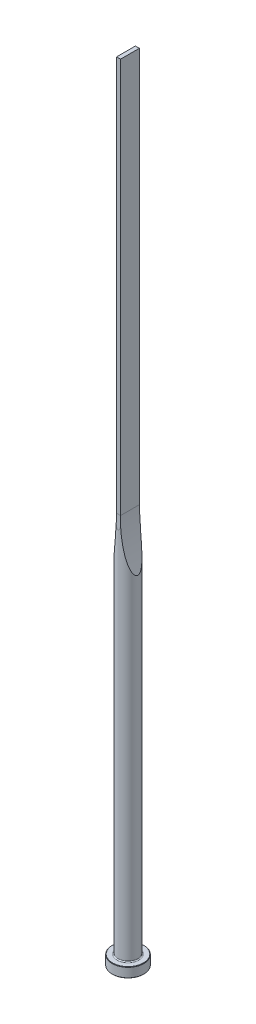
from build123d import *

# Parameters (mm, degrees)
CUT_EXTRUDE1_DEPTH = 5
CUT_EXTRUDE2_DEPTH = 5


with BuildPart() as part:
    # Sketch1 → Revolve1 (revolve)
    with BuildSketch(Plane.XY, mode=Mode.PRIVATE) as revolve1_sk:
        with BuildLine():
            Line((0, 0), (7.8, 0))
            Line((7.8, 0), (8, 0.2))
            Line((8, 0.2), (8, 4.8))
            Line((8, 4.8), (7.8, 5))
            Line((7.8, 5), (5.5, 5))
            ThreePointArc((5.5, 5), (5.146446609, 5.146446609), (5, 5.5))
            Line((5, 5.5), (5, 400))
            Line((5, 400), (0, 400))
            Line((0, 400), (0, 0))
        make_face()
    revolve(revolve1_sk.sketch.rotate(Axis((0, 400, 0), (0, -1, 0)), 180), axis=Axis((0, 400, 0), (0, -1, 0)))

    # Sketch2 → Cut-Extrude1 (cut, symmetric)
    with BuildSketch(Plane.XY):
        with BuildLine():
            Line((1, 400), (1, 200))
            ThreePointArc((1, 200), (2.005618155, 186.583592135), (5, 173.467001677))
            Line((5, 173.467001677), (5, 400))
            Line((5, 400), (1, 400))
        make_face()
        with BuildLine():
            Line((-1, 400), (-1, 200))
            ThreePointArc((-1, 200), (-2.005618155, 186.583592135), (-5, 173.467001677))
            Line((-5, 173.467001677), (-5, 400))
            Line((-5, 400), (-1, 400))
        make_face()
    extrude(amount=CUT_EXTRUDE1_DEPTH, both=True, mode=Mode.SUBTRACT)

    # Sketch3 → Cut-Extrude2 (cut, symmetric)
    with BuildSketch(Plane(origin=(0, 0, 0), x_dir=(0, 0, -1), z_dir=(1, 0, 0))):
        with BuildLine():
            Line((4.75, 400), (4.75, 200))
            ThreePointArc((4.75, 200), (4.812521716, 196.645898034), (5, 193.296456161))
            Line((5, 193.296456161), (5, 400))
            Line((5, 400), (4.75, 400))
        make_face()
        with BuildLine():
            Line((-4.75, 400), (-4.75, 200))
            ThreePointArc((-4.75, 200), (-4.812521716, 196.645898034), (-5, 193.296456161))
            Line((-5, 193.296456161), (-5, 400))
            Line((-5, 400), (-4.75, 400))
        make_face()
    extrude(amount=CUT_EXTRUDE2_DEPTH, both=True, mode=Mode.SUBTRACT)


solid = part.part
